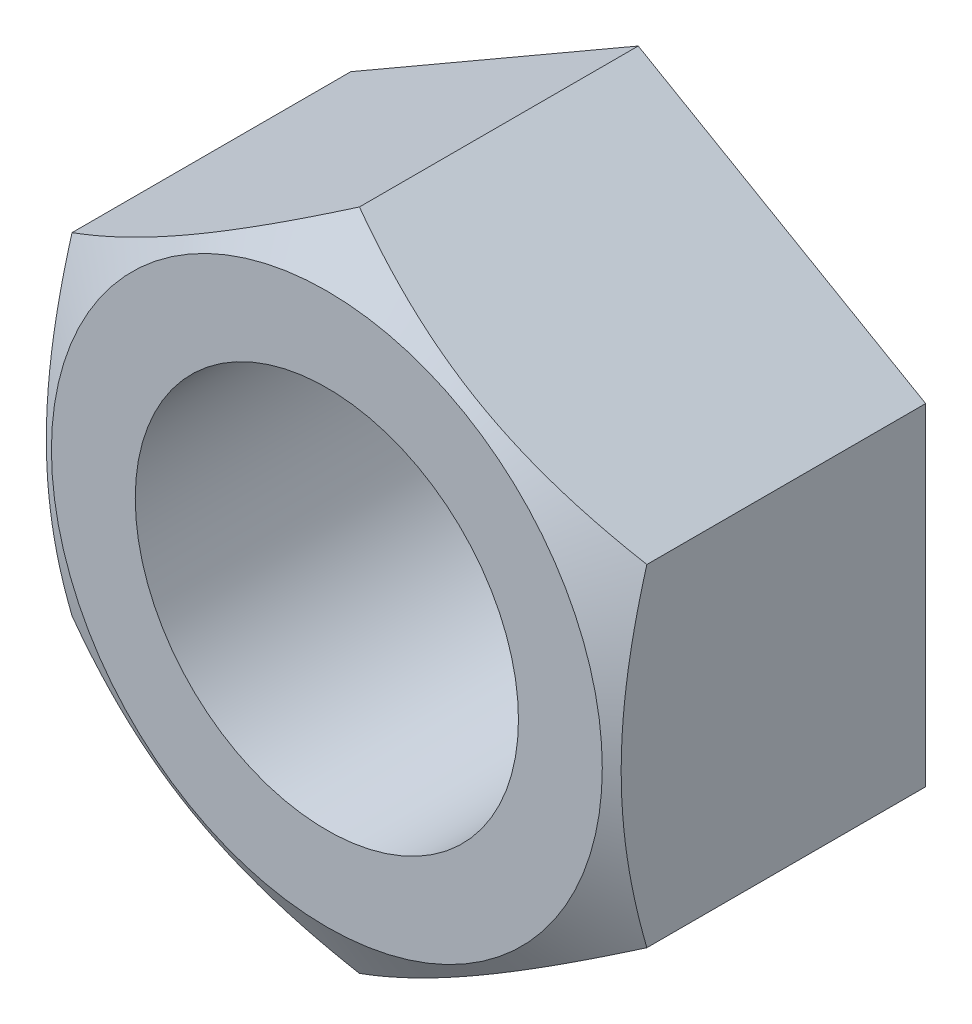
ISO-10303-21;
HEADER;
FILE_DESCRIPTION(('STEP AP214'),'2;1');
FILE_NAME('part.step','',(''),(''),'','','');
FILE_SCHEMA(('AUTOMOTIVE_DESIGN { 1 0 10303 214 1 1 1 1 }'));
ENDSEC;
DATA;
#1=APPLICATION_CONTEXT('core data for automotive mechanical design processes');
#2=APPLICATION_PROTOCOL_DEFINITION('international standard','automotive_design',2000,#1);
#3=PRODUCT_CONTEXT('',#1,'mechanical');
#4=PRODUCT('Part','Part','',(#3));
#5=PRODUCT_RELATED_PRODUCT_CATEGORY('part','',(#4));
#6=PRODUCT_DEFINITION_FORMATION('','',#4);
#7=PRODUCT_DEFINITION_CONTEXT('part definition',#1,'design');
#8=PRODUCT_DEFINITION('design','',#6,#7);
#9=PRODUCT_DEFINITION_SHAPE('','',#8);
#10=(LENGTH_UNIT() NAMED_UNIT(*) SI_UNIT(.MILLI.,.METRE.));
#11=(NAMED_UNIT(*) PLANE_ANGLE_UNIT() SI_UNIT($,.RADIAN.));
#12=(NAMED_UNIT(*) SI_UNIT($,.STERADIAN.) SOLID_ANGLE_UNIT());
#13=UNCERTAINTY_MEASURE_WITH_UNIT(LENGTH_MEASURE(1.E-05),#10,'distance_accuracy_value','');
#14=(GEOMETRIC_REPRESENTATION_CONTEXT(3) GLOBAL_UNCERTAINTY_ASSIGNED_CONTEXT((#13)) GLOBAL_UNIT_ASSIGNED_CONTEXT((#10,
#11,#12)) REPRESENTATION_CONTEXT('',''));
#15=CARTESIAN_POINT('',(0.,0.,0.));
#16=DIRECTION('',(0.,0.,1.));
#17=DIRECTION('',(1.,0.,0.));
#18=AXIS2_PLACEMENT_3D('',#15,#16,#17);
#19=CARTESIAN_POINT('',(-12.,-6.92820323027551,13.));
#20=DIRECTION('',(-1.,0.,0.));
#21=DIRECTION('',(0.,0.,1.));
#22=AXIS2_PLACEMENT_3D('',#19,#20,#21);
#23=PLANE('',#22);
#24=DIRECTION('',(0.,1.,0.));
#25=VECTOR('',#24,1.);
#26=CARTESIAN_POINT('',(-12.,-6.92820323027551,0.));
#27=LINE('',#26,#25);
#28=CARTESIAN_POINT('',(-12.,-6.92820323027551,0.));
#29=VERTEX_POINT('',#28);
#30=CARTESIAN_POINT('',(-12.,6.92820323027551,0.));
#31=VERTEX_POINT('',#30);
#32=EDGE_CURVE('E97',#29,#31,#27,.T.);
#33=ORIENTED_EDGE('',*,*,#32,.F.);
#34=DIRECTION('',(0.,0.,-1.));
#35=VECTOR('',#34,1.);
#36=CARTESIAN_POINT('',(-12.,-6.92820323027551,13.));
#37=LINE('',#36,#35);
#38=CARTESIAN_POINT('',(-12.,-6.92820323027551,11.6395280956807));
#39=VERTEX_POINT('',#38);
#40=EDGE_CURVE('E9',#39,#29,#37,.T.);
#41=ORIENTED_EDGE('',*,*,#40,.F.);
#42=CARTESIAN_POINT('',(-12.,-18.5511120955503,6.88356530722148));
#43=CARTESIAN_POINT('',(-12.,-18.2893056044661,7.01047861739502));
#44=CARTESIAN_POINT('',(-12.,-18.0271902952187,7.13675456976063));
#45=CARTESIAN_POINT('',(-12.,-17.5022775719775,7.38788728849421));
#46=CARTESIAN_POINT('',(-12.,-17.2394801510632,7.51274404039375));
#47=CARTESIAN_POINT('',(-12.,-16.4498972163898,7.88500207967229));
#48=CARTESIAN_POINT('',(-12.,-15.9219993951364,8.13005305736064));
#49=CARTESIAN_POINT('',(-12.,-14.8597501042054,8.61372635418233));
#50=CARTESIAN_POINT('',(-12.,-14.325379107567,8.85230589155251));
#51=CARTESIAN_POINT('',(-12.,-13.2523667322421,9.31962618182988));
#52=CARTESIAN_POINT('',(-12.,-12.7137255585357,9.54836740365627));
#53=CARTESIAN_POINT('',(-12.,-11.6141666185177,10.0004566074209));
#54=CARTESIAN_POINT('',(-12.,-11.053083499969,10.223404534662));
#55=CARTESIAN_POINT('',(-12.,-9.92432726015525,10.6522845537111));
#56=CARTESIAN_POINT('',(-12.,-9.35665340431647,10.8582147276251));
#57=CARTESIAN_POINT('',(-12.,-8.21491291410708,11.2476070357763));
#58=CARTESIAN_POINT('',(-12.,-7.64086209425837,11.4311151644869));
#59=CARTESIAN_POINT('',(-12.,-6.48447180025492,11.7697460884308));
#60=CARTESIAN_POINT('',(-12.,-5.90213501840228,11.9248778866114));
#61=CARTESIAN_POINT('',(-12.,-5.02392332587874,12.1302284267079));
#62=CARTESIAN_POINT('',(-12.,-4.73119449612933,12.1939857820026));
#63=CARTESIAN_POINT('',(-12.,-4.14374776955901,12.3116189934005));
#64=CARTESIAN_POINT('',(-12.,-3.84902991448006,12.3654950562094));
#65=CARTESIAN_POINT('',(-12.,-3.25781233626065,12.4624111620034));
#66=CARTESIAN_POINT('',(-12.,-2.96131263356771,12.5054513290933));
#67=CARTESIAN_POINT('',(-12.,-2.36685078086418,12.5798348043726));
#68=CARTESIAN_POINT('',(-12.,-2.06888868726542,12.6111785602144));
#69=CARTESIAN_POINT('',(-12.,-1.4757830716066,12.6611568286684));
#70=CARTESIAN_POINT('',(-12.,-1.1806530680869,12.6799507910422));
#71=CARTESIAN_POINT('',(-12.,-0.58986359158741,12.7050451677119));
#72=CARTESIAN_POINT('',(-12.,-0.294204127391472,12.7113457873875));
#73=CARTESIAN_POINT('',(-12.,0.297117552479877,12.7113038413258));
#74=CARTESIAN_POINT('',(-12.,0.592779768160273,12.7049611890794));
#75=CARTESIAN_POINT('',(-12.,1.18357555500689,12.6797863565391));
#76=CARTESIAN_POINT('',(-12.,1.47870910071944,12.6609535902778));
#77=CARTESIAN_POINT('',(-12.,2.18979135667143,12.6009289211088));
#78=CARTESIAN_POINT('',(-12.,2.60524027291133,12.5537118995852));
#79=CARTESIAN_POINT('',(-12.,3.43301837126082,12.4371140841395));
#80=CARTESIAN_POINT('',(-12.,3.84534711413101,12.3677302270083));
#81=CARTESIAN_POINT('',(-12.,4.66650397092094,12.2092670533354));
#82=CARTESIAN_POINT('',(-12.,5.07532906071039,12.1201722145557));
#83=CARTESIAN_POINT('',(-12.,5.88886052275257,11.9250022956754));
#84=CARTESIAN_POINT('',(-12.,6.29356696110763,11.8189274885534));
#85=CARTESIAN_POINT('',(-12.,7.10774269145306,11.5898730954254));
#86=CARTESIAN_POINT('',(-12.,7.51712127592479,11.466573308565));
#87=CARTESIAN_POINT('',(-12.,8.3318448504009,11.2073659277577));
#88=CARTESIAN_POINT('',(-12.,8.73718981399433,11.0714582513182));
#89=CARTESIAN_POINT('',(-12.,9.54404896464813,10.7891815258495));
#90=CARTESIAN_POINT('',(-12.,9.94556440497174,10.6428160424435));
#91=CARTESIAN_POINT('',(-12.,10.7452767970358,10.3413327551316));
#92=CARTESIAN_POINT('',(-12.,11.1434737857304,10.18621504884));
#93=CARTESIAN_POINT('',(-12.,12.0754680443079,9.81323891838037));
#94=CARTESIAN_POINT('',(-12.,12.6080647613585,9.59238523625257));
#95=CARTESIAN_POINT('',(-12.,13.6688002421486,9.14019003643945));
#96=CARTESIAN_POINT('',(-12.,14.1969387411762,8.90884790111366));
#97=CARTESIAN_POINT('',(-12.,15.2495787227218,8.43775599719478));
#98=CARTESIAN_POINT('',(-12.,15.7740794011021,8.19800443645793));
#99=CARTESIAN_POINT('',(-12.,16.8199320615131,7.71177289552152));
#100=CARTESIAN_POINT('',(-12.,17.3412841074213,7.46529305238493));
#101=CARTESIAN_POINT('',(-12.,18.3819084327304,6.96658700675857));
#102=CARTESIAN_POINT('',(-12.,18.9011779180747,6.71435498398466));
#103=CARTESIAN_POINT('',(-12.,19.9374970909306,6.20537220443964));
#104=CARTESIAN_POINT('',(-12.,20.4545467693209,5.94862142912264));
#105=CARTESIAN_POINT('',(-12.,21.4867006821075,5.43140110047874));
#106=CARTESIAN_POINT('',(-12.,22.0018051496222,5.17093201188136));
#107=CARTESIAN_POINT('',(-12.,23.0304116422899,4.64684705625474));
#108=CARTESIAN_POINT('',(-12.,23.5439136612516,4.38323117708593));
#109=CARTESIAN_POINT('',(-12.,24.9976252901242,3.63219356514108));
#110=CARTESIAN_POINT('',(-12.,25.9362166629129,3.14163958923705));
#111=CARTESIAN_POINT('',(-12.,27.8099140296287,2.15385898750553));
#112=CARTESIAN_POINT('',(-12.,28.745019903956,1.65663213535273));
#113=CARTESIAN_POINT('',(-12.,30.6102319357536,0.65827060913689));
#114=CARTESIAN_POINT('',(-12.,31.5403447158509,0.157148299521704));
#115=CARTESIAN_POINT('',(-12.,32.9338661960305,-0.59751506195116));
#116=CARTESIAN_POINT('',(-12.,33.3980865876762,-0.84955951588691));
#117=CARTESIAN_POINT('',(-12.,34.326039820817,-1.35454271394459));
#118=CARTESIAN_POINT('',(-12.,34.7897726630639,-1.60748145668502));
#119=CARTESIAN_POINT('',(-12.,35.2532891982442,-1.86081608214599));
#120=B_SPLINE_CURVE_WITH_KNOTS('',3,(#42,#43,#44,#45,#46,#47,#48,#49,#50,#51,#52,#53,#54,#55,
#56,#57,#58,#59,#60,#61,#62,#63,#64,#65,#66,#67,#68,#69,#70,#71,#72,#73,#74,#75,#76,#77,#78,#79,
#80,#81,#82,#83,#84,#85,#86,#87,#88,#89,#90,#91,#92,#93,#94,#95,#96,#97,#98,#99,#100,#101,#102,
#103,#104,#105,#106,#107,#108,#109,#110,#111,#112,#113,#114,#115,#116,#117,#118,#119),
.UNSPECIFIED.,.F.,.F.,(4,2,2,2,2,2,2,2,2,2,2,2,2,2,2,2,2,2,2,2,2,2,2,2,2,2,2,2,2,2,2,2,2,2,2,2,
2,2,4),(0.,0.872836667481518,1.74568222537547,3.49163472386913,5.24719213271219,
7.00266577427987,8.81371989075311,10.624977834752,12.4324556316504,14.2393589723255,
15.1379941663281,16.03661055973,16.9352166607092,17.8337883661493,18.7207143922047,
19.6076258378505,20.4945433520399,21.3815024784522,22.6351779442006,23.8890267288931,
25.1438664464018,26.3986859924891,27.6810742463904,28.9634708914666,30.2454323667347,
31.5273795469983,33.2569446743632,34.9866117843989,36.7166497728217,38.4466525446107,
40.1784911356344,41.9103368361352,43.6419679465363,45.3736057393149,48.5507294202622,
51.7279611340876,54.89750618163,56.4821955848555,58.0668825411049),.UNSPECIFIED.);
#121=CARTESIAN_POINT('',(-12.,6.92820323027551,11.6395280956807));
#122=VERTEX_POINT('',#121);
#123=EDGE_CURVE('E36',#39,#122,#120,.T.);
#124=ORIENTED_EDGE('',*,*,#123,.T.);
#125=DIRECTION('',(0.,0.,-1.));
#126=VECTOR('',#125,1.);
#127=CARTESIAN_POINT('',(-12.,6.92820323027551,13.));
#128=LINE('',#127,#126);
#129=EDGE_CURVE('E177',#122,#31,#128,.T.);
#130=ORIENTED_EDGE('',*,*,#129,.T.);
#131=EDGE_LOOP('',(#33,#41,#124,#130));
#132=FACE_BOUND('',#131,.T.);
#133=ADVANCED_FACE('F14',(#132),#23,.T.);
#134=CARTESIAN_POINT('',(-12.,-6.92820323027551,13.));
#135=DIRECTION('',(0.5,0.86602540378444,0.));
#136=DIRECTION('',(-0.86602540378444,0.5,0.));
#137=AXIS2_PLACEMENT_3D('',#134,#135,#136);
#138=PLANE('',#137);
#139=DIRECTION('',(-0.866025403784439,0.5,0.));
#140=VECTOR('',#139,1.);
#141=CARTESIAN_POINT('',(0.,-13.856406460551,0.));
#142=LINE('',#141,#140);
#143=CARTESIAN_POINT('',(0.,-13.856406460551,0.));
#144=VERTEX_POINT('',#143);
#145=EDGE_CURVE('E94',#144,#29,#142,.T.);
#146=ORIENTED_EDGE('',*,*,#145,.F.);
#147=DIRECTION('',(0.,0.,-1.));
#148=VECTOR('',#147,1.);
#149=CARTESIAN_POINT('',(0.,-13.856406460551,13.));
#150=LINE('',#149,#148);
#151=CARTESIAN_POINT('',(0.,-13.856406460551,11.6395280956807));
#152=VERTEX_POINT('',#151);
#153=EDGE_CURVE('E23',#152,#144,#150,.T.);
#154=ORIENTED_EDGE('',*,*,#153,.F.);
#155=CARTESIAN_POINT('',(-12.0002,-6.92808776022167,11.6394614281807));
#156=CARTESIAN_POINT('',(-11.7364142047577,-7.08038456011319,11.7273752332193));
#157=CARTESIAN_POINT('',(-11.4716448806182,-7.2332492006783,11.8112988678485));
#158=CARTESIAN_POINT('',(-10.9399829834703,-7.54020434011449,11.9700586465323));
#159=CARTESIAN_POINT('',(-10.6730897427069,-7.69429522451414,12.0448918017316));
#160=CARTESIAN_POINT('',(-9.86810959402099,-8.15905073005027,12.254307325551));
#161=CARTESIAN_POINT('',(-9.3268449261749,-8.47155003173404,12.3734216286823));
#162=CARTESIAN_POINT('',(-8.51686717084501,-8.93919090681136,12.513093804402));
#163=CARTESIAN_POINT('',(-8.25057389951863,-9.09293539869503,12.5528810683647));
#164=CARTESIAN_POINT('',(-7.71675440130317,-9.4011362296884,12.6196014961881));
#165=CARTESIAN_POINT('',(-7.44922815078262,-9.55559258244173,12.6465344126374));
#166=CARTESIAN_POINT('',(-6.91372963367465,-9.86476279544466,12.6868562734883));
#167=CARTESIAN_POINT('',(-6.64575827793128,-10.0194761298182,12.7002613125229));
#168=CARTESIAN_POINT('',(-6.10956726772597,-10.3290461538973,12.713241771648));
#169=CARTESIAN_POINT('',(-5.84134762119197,-10.4839028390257,12.7128176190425));
#170=CARTESIAN_POINT('',(-5.3399106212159,-10.7734076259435,12.6991048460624));
#171=CARTESIAN_POINT('',(-5.10665750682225,-10.908076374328,12.6874888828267));
#172=CARTESIAN_POINT('',(-4.64068775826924,-11.1771041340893,12.6540168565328));
#173=CARTESIAN_POINT('',(-4.40797116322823,-11.3114631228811,12.632160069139));
#174=CARTESIAN_POINT('',(-3.94320092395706,-11.5797983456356,12.5785874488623));
#175=CARTESIAN_POINT('',(-3.711147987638,-11.7137741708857,12.5468634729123));
#176=CARTESIAN_POINT('',(-3.24813003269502,-11.9810977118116,12.4741130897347));
#177=CARTESIAN_POINT('',(-3.01716508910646,-12.1144453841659,12.433086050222));
#178=CARTESIAN_POINT('',(-2.31605804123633,-12.5192297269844,12.2950132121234));
#179=CARTESIAN_POINT('',(-1.84794625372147,-12.789494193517,12.1841999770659));
#180=CARTESIAN_POINT('',(-0.918702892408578,-13.3259930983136,11.9326990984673));
#181=CARTESIAN_POINT('',(-0.457559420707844,-13.5922344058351,11.7920705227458));
#182=CARTESIAN_POINT('',(0.000200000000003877,-13.8565219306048,11.6394614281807));
#183=B_SPLINE_CURVE_WITH_KNOTS('',3,(#155,#156,#157,#158,#159,#160,#161,#162,#163,#164,#165,
#166,#167,#168,#169,#170,#171,#172,#173,#174,#175,#176,#177,#178,#179,#180,#181,#182),
.UNSPECIFIED.,.F.,.F.,(4,2,2,2,2,2,2,2,2,2,2,2,2,4),(0.,0.951004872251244,1.90232158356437,
3.80900466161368,4.7389455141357,5.66890426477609,6.59775529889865,7.5265776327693,
8.33514643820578,9.14377244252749,9.95306755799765,10.7624176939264,12.4167102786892,
14.0677556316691),.UNSPECIFIED.);
#184=EDGE_CURVE('E146',#39,#152,#183,.T.);
#185=ORIENTED_EDGE('',*,*,#184,.F.);
#186=ORIENTED_EDGE('',*,*,#40,.T.);
#187=EDGE_LOOP('',(#146,#154,#185,#186));
#188=FACE_BOUND('',#187,.T.);
#189=ADVANCED_FACE('F16',(#188),#138,.F.);
#190=CARTESIAN_POINT('',(12.,-6.9282032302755,13.));
#191=DIRECTION('',(0.5,-0.866025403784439,0.));
#192=DIRECTION('',(0.86602540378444,0.5,0.));
#193=AXIS2_PLACEMENT_3D('',#190,#191,#192);
#194=PLANE('',#193);
#195=DIRECTION('',(-0.866025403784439,-0.5,0.));
#196=VECTOR('',#195,1.);
#197=CARTESIAN_POINT('',(12.,-6.9282032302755,0.));
#198=LINE('',#197,#196);
#199=CARTESIAN_POINT('',(12.,-6.9282032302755,0.));
#200=VERTEX_POINT('',#199);
#201=EDGE_CURVE('E85',#200,#144,#198,.T.);
#202=ORIENTED_EDGE('',*,*,#201,.F.);
#203=DIRECTION('',(0.,0.,-1.));
#204=VECTOR('',#203,1.);
#205=CARTESIAN_POINT('',(12.,-6.9282032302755,13.));
#206=LINE('',#205,#204);
#207=CARTESIAN_POINT('',(12.,-6.9282032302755,11.6395280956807));
#208=VERTEX_POINT('',#207);
#209=EDGE_CURVE('E75',#208,#200,#206,.T.);
#210=ORIENTED_EDGE('',*,*,#209,.F.);
#211=CARTESIAN_POINT('',(12.0002,-6.92808776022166,11.6394614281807));
#212=CARTESIAN_POINT('',(11.7364142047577,-7.08038456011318,11.7273752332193));
#213=CARTESIAN_POINT('',(11.4716448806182,-7.2332492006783,11.8112988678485));
#214=CARTESIAN_POINT('',(10.9399829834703,-7.54020434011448,11.9700586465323));
#215=CARTESIAN_POINT('',(10.6730897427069,-7.69429522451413,12.0448918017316));
#216=CARTESIAN_POINT('',(9.86810959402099,-8.15905073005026,12.254307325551));
#217=CARTESIAN_POINT('',(9.3268449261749,-8.47155003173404,12.3734216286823));
#218=CARTESIAN_POINT('',(8.51686717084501,-8.93919090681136,12.513093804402));
#219=CARTESIAN_POINT('',(8.25057389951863,-9.09293539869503,12.5528810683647));
#220=CARTESIAN_POINT('',(7.71675440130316,-9.4011362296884,12.6196014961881));
#221=CARTESIAN_POINT('',(7.44922815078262,-9.55559258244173,12.6465344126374));
#222=CARTESIAN_POINT('',(6.91372963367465,-9.86476279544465,12.6868562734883));
#223=CARTESIAN_POINT('',(6.64575827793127,-10.0194761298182,12.7002613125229));
#224=CARTESIAN_POINT('',(6.10956726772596,-10.3290461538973,12.713241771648));
#225=CARTESIAN_POINT('',(5.84134762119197,-10.4839028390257,12.7128176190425));
#226=CARTESIAN_POINT('',(5.3399106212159,-10.7734076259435,12.6991048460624));
#227=CARTESIAN_POINT('',(5.10665750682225,-10.908076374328,12.6874888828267));
#228=CARTESIAN_POINT('',(4.64068775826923,-11.1771041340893,12.6540168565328));
#229=CARTESIAN_POINT('',(4.40797116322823,-11.3114631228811,12.632160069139));
#230=CARTESIAN_POINT('',(3.94320092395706,-11.5797983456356,12.5785874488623));
#231=CARTESIAN_POINT('',(3.711147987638,-11.7137741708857,12.5468634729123));
#232=CARTESIAN_POINT('',(3.24813003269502,-11.9810977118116,12.4741130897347));
#233=CARTESIAN_POINT('',(3.01716508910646,-12.1144453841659,12.433086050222));
#234=CARTESIAN_POINT('',(2.31605804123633,-12.5192297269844,12.2950132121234));
#235=CARTESIAN_POINT('',(1.84794625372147,-12.789494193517,12.1841999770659));
#236=CARTESIAN_POINT('',(0.918702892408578,-13.3259930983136,11.9326990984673));
#237=CARTESIAN_POINT('',(0.457559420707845,-13.5922344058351,11.7920705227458));
#238=CARTESIAN_POINT('',(-0.000200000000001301,-13.8565219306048,11.6394614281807));
#239=B_SPLINE_CURVE_WITH_KNOTS('',3,(#211,#212,#213,#214,#215,#216,#217,#218,#219,#220,#221,
#222,#223,#224,#225,#226,#227,#228,#229,#230,#231,#232,#233,#234,#235,#236,#237,#238),
.UNSPECIFIED.,.F.,.F.,(4,2,2,2,2,2,2,2,2,2,2,2,2,4),(0.,0.951004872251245,1.90232158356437,
3.80900466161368,4.7389455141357,5.66890426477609,6.59775529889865,7.5265776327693,
8.33514643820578,9.14377244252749,9.95306755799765,10.7624176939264,12.4167102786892,
14.0677556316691),.UNSPECIFIED.);
#240=EDGE_CURVE('E140',#208,#152,#239,.T.);
#241=ORIENTED_EDGE('',*,*,#240,.T.);
#242=ORIENTED_EDGE('',*,*,#153,.T.);
#243=EDGE_LOOP('',(#202,#210,#241,#242));
#244=FACE_BOUND('',#243,.T.);
#245=ADVANCED_FACE('F185',(#244),#194,.T.);
#246=CARTESIAN_POINT('',(12.,-6.9282032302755,13.));
#247=DIRECTION('',(-1.,0.,0.));
#248=DIRECTION('',(0.,0.,1.));
#249=AXIS2_PLACEMENT_3D('',#246,#247,#248);
#250=PLANE('',#249);
#251=DIRECTION('',(0.,-1.,0.));
#252=VECTOR('',#251,1.);
#253=CARTESIAN_POINT('',(12.,6.92820323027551,0.));
#254=LINE('',#253,#252);
#255=CARTESIAN_POINT('',(12.,6.92820323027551,0.));
#256=VERTEX_POINT('',#255);
#257=EDGE_CURVE('E79',#256,#200,#254,.T.);
#258=ORIENTED_EDGE('',*,*,#257,.F.);
#259=DIRECTION('',(0.,0.,-1.));
#260=VECTOR('',#259,1.);
#261=CARTESIAN_POINT('',(12.,6.92820323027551,13.));
#262=LINE('',#261,#260);
#263=CARTESIAN_POINT('',(12.,6.92820323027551,11.6395280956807));
#264=VERTEX_POINT('',#263);
#265=EDGE_CURVE('E66',#264,#256,#262,.T.);
#266=ORIENTED_EDGE('',*,*,#265,.F.);
#267=CARTESIAN_POINT('',(12.,-18.5511120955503,6.88356530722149));
#268=CARTESIAN_POINT('',(12.,-18.2893056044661,7.01047861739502));
#269=CARTESIAN_POINT('',(12.,-18.0271902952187,7.13675456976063));
#270=CARTESIAN_POINT('',(12.,-17.5022775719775,7.38788728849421));
#271=CARTESIAN_POINT('',(12.,-17.2394801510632,7.51274404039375));
#272=CARTESIAN_POINT('',(12.,-16.4498972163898,7.88500207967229));
#273=CARTESIAN_POINT('',(12.,-15.9219993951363,8.13005305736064));
#274=CARTESIAN_POINT('',(12.,-14.8597501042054,8.61372635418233));
#275=CARTESIAN_POINT('',(12.,-14.325379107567,8.85230589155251));
#276=CARTESIAN_POINT('',(12.,-13.2523667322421,9.31962618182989));
#277=CARTESIAN_POINT('',(12.,-12.7137255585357,9.54836740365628));
#278=CARTESIAN_POINT('',(12.,-11.6141666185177,10.0004566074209));
#279=CARTESIAN_POINT('',(12.,-11.053083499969,10.223404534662));
#280=CARTESIAN_POINT('',(12.,-9.92432726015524,10.6522845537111));
#281=CARTESIAN_POINT('',(12.,-9.35665340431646,10.8582147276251));
#282=CARTESIAN_POINT('',(12.,-8.21491291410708,11.2476070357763));
#283=CARTESIAN_POINT('',(12.,-7.64086209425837,11.4311151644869));
#284=CARTESIAN_POINT('',(12.,-6.48447180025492,11.7697460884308));
#285=CARTESIAN_POINT('',(12.,-5.90213501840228,11.9248778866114));
#286=CARTESIAN_POINT('',(12.,-5.02392332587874,12.1302284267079));
#287=CARTESIAN_POINT('',(12.,-4.73119449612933,12.1939857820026));
#288=CARTESIAN_POINT('',(12.,-4.14374776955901,12.3116189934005));
#289=CARTESIAN_POINT('',(12.,-3.84902991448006,12.3654950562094));
#290=CARTESIAN_POINT('',(12.,-3.25781233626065,12.4624111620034));
#291=CARTESIAN_POINT('',(12.,-2.9613126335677,12.5054513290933));
#292=CARTESIAN_POINT('',(12.,-2.36685078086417,12.5798348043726));
#293=CARTESIAN_POINT('',(12.,-2.06888868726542,12.6111785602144));
#294=CARTESIAN_POINT('',(12.,-1.4757830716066,12.6611568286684));
#295=CARTESIAN_POINT('',(12.,-1.1806530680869,12.6799507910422));
#296=CARTESIAN_POINT('',(12.,-0.589863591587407,12.7050451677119));
#297=CARTESIAN_POINT('',(12.,-0.294204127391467,12.7113457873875));
#298=CARTESIAN_POINT('',(12.,0.297117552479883,12.7113038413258));
#299=CARTESIAN_POINT('',(12.,0.592779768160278,12.7049611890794));
#300=CARTESIAN_POINT('',(12.,1.18357555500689,12.6797863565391));
#301=CARTESIAN_POINT('',(12.,1.47870910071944,12.6609535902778));
#302=CARTESIAN_POINT('',(12.,2.18979135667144,12.6009289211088));
#303=CARTESIAN_POINT('',(12.,2.60524027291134,12.5537118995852));
#304=CARTESIAN_POINT('',(12.,3.43301837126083,12.4371140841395));
#305=CARTESIAN_POINT('',(12.,3.84534711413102,12.3677302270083));
#306=CARTESIAN_POINT('',(12.,4.66650397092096,12.2092670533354));
#307=CARTESIAN_POINT('',(12.,5.07532906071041,12.1201722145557));
#308=CARTESIAN_POINT('',(12.,5.88886052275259,11.9250022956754));
#309=CARTESIAN_POINT('',(12.,6.29356696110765,11.8189274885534));
#310=CARTESIAN_POINT('',(12.,7.10774269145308,11.5898730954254));
#311=CARTESIAN_POINT('',(12.,7.51712127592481,11.466573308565));
#312=CARTESIAN_POINT('',(12.,8.33184485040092,11.2073659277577));
#313=CARTESIAN_POINT('',(12.,8.73718981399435,11.0714582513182));
#314=CARTESIAN_POINT('',(12.,9.54404896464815,10.7891815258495));
#315=CARTESIAN_POINT('',(12.,9.94556440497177,10.6428160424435));
#316=CARTESIAN_POINT('',(12.,10.7452767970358,10.3413327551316));
#317=CARTESIAN_POINT('',(12.,11.1434737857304,10.18621504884));
#318=CARTESIAN_POINT('',(12.,12.0754680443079,9.81323891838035));
#319=CARTESIAN_POINT('',(12.,12.6080647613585,9.59238523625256));
#320=CARTESIAN_POINT('',(12.,13.6688002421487,9.14019003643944));
#321=CARTESIAN_POINT('',(12.,14.1969387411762,8.90884790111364));
#322=CARTESIAN_POINT('',(12.,15.2495787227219,8.43775599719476));
#323=CARTESIAN_POINT('',(12.,15.7740794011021,8.19800443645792));
#324=CARTESIAN_POINT('',(12.,16.8199320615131,7.71177289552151));
#325=CARTESIAN_POINT('',(12.,17.3412841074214,7.46529305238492));
#326=CARTESIAN_POINT('',(12.,18.3819084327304,6.96658700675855));
#327=CARTESIAN_POINT('',(12.,18.9011779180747,6.71435498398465));
#328=CARTESIAN_POINT('',(12.,19.9374970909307,6.20537220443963));
#329=CARTESIAN_POINT('',(12.,20.4545467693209,5.94862142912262));
#330=CARTESIAN_POINT('',(12.,21.4867006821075,5.43140110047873));
#331=CARTESIAN_POINT('',(12.,22.0018051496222,5.17093201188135));
#332=CARTESIAN_POINT('',(12.,23.03041164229,4.64684705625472));
#333=CARTESIAN_POINT('',(12.,23.5439136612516,4.38323117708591));
#334=CARTESIAN_POINT('',(12.,24.9976252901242,3.63219356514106));
#335=CARTESIAN_POINT('',(12.,25.9362166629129,3.14163958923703));
#336=CARTESIAN_POINT('',(12.,27.8099140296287,2.15385898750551));
#337=CARTESIAN_POINT('',(12.,28.745019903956,1.65663213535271));
#338=CARTESIAN_POINT('',(12.,30.6102319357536,0.658270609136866));
#339=CARTESIAN_POINT('',(12.,31.5403447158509,0.157148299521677));
#340=CARTESIAN_POINT('',(12.,32.9338661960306,-0.597515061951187));
#341=CARTESIAN_POINT('',(12.,33.3980865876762,-0.849559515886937));
#342=CARTESIAN_POINT('',(12.,34.3260398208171,-1.35454271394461));
#343=CARTESIAN_POINT('',(12.,34.7897726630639,-1.60748145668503));
#344=CARTESIAN_POINT('',(12.,35.2532891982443,-1.86081608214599));
#345=B_SPLINE_CURVE_WITH_KNOTS('',3,(#267,#268,#269,#270,#271,#272,#273,#274,#275,#276,#277,
#278,#279,#280,#281,#282,#283,#284,#285,#286,#287,#288,#289,#290,#291,#292,#293,#294,#295,#296,
#297,#298,#299,#300,#301,#302,#303,#304,#305,#306,#307,#308,#309,#310,#311,#312,#313,#314,#315,
#316,#317,#318,#319,#320,#321,#322,#323,#324,#325,#326,#327,#328,#329,#330,#331,#332,#333,#334,
#335,#336,#337,#338,#339,#340,#341,#342,#343,#344),.UNSPECIFIED.,.F.,.F.,(4,2,2,2,2,2,2,2,2,2,2,
2,2,2,2,2,2,2,2,2,2,2,2,2,2,2,2,2,2,2,2,2,2,2,2,2,2,2,4),(0.,0.872836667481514,1.74568222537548,
3.49163472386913,5.2471921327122,7.00266577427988,8.81371989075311,10.624977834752,
12.4324556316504,14.2393589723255,15.1379941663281,16.03661055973,16.9352166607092,
17.8337883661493,18.7207143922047,19.6076258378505,20.4945433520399,21.3815024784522,
22.6351779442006,23.8890267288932,25.1438664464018,26.3986859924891,27.6810742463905,
28.9634708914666,30.2454323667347,31.5273795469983,33.2569446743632,34.9866117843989,
36.7166497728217,38.4466525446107,40.1784911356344,41.9103368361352,43.6419679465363,
45.3736057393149,48.5507294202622,51.7279611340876,54.8975061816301,56.4821955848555,
58.066882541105),.UNSPECIFIED.);
#346=EDGE_CURVE('E133',#208,#264,#345,.T.);
#347=ORIENTED_EDGE('',*,*,#346,.F.);
#348=ORIENTED_EDGE('',*,*,#209,.T.);
#349=EDGE_LOOP('',(#258,#266,#347,#348));
#350=FACE_BOUND('',#349,.T.);
#351=ADVANCED_FACE('F80',(#350),#250,.F.);
#352=CARTESIAN_POINT('',(12.,6.92820323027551,13.));
#353=DIRECTION('',(-0.5,-0.86602540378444,0.));
#354=DIRECTION('',(0.86602540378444,-0.5,0.));
#355=AXIS2_PLACEMENT_3D('',#352,#353,#354);
#356=PLANE('',#355);
#357=DIRECTION('',(0.866025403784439,-0.5,0.));
#358=VECTOR('',#357,1.);
#359=CARTESIAN_POINT('',(0.,13.856406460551,0.));
#360=LINE('',#359,#358);
#361=CARTESIAN_POINT('',(0.,13.856406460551,0.));
#362=VERTEX_POINT('',#361);
#363=EDGE_CURVE('E71',#362,#256,#360,.T.);
#364=ORIENTED_EDGE('',*,*,#363,.F.);
#365=DIRECTION('',(0.,0.,-1.));
#366=VECTOR('',#365,1.);
#367=CARTESIAN_POINT('',(0.,13.856406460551,13.));
#368=LINE('',#367,#366);
#369=CARTESIAN_POINT('',(0.,13.856406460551,11.6395280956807));
#370=VERTEX_POINT('',#369);
#371=EDGE_CURVE('E76',#370,#362,#368,.T.);
#372=ORIENTED_EDGE('',*,*,#371,.F.);
#373=CARTESIAN_POINT('',(12.0002,6.92808776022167,11.6394614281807));
#374=CARTESIAN_POINT('',(11.7364142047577,7.08038456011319,11.7273752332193));
#375=CARTESIAN_POINT('',(11.4716448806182,7.2332492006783,11.8112988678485));
#376=CARTESIAN_POINT('',(10.9399829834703,7.54020434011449,11.9700586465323));
#377=CARTESIAN_POINT('',(10.6730897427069,7.69429522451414,12.0448918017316));
#378=CARTESIAN_POINT('',(9.86810959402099,8.15905073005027,12.254307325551));
#379=CARTESIAN_POINT('',(9.3268449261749,8.47155003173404,12.3734216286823));
#380=CARTESIAN_POINT('',(8.51686717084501,8.93919090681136,12.513093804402));
#381=CARTESIAN_POINT('',(8.25057389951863,9.09293539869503,12.5528810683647));
#382=CARTESIAN_POINT('',(7.71675440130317,9.4011362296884,12.6196014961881));
#383=CARTESIAN_POINT('',(7.44922815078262,9.55559258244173,12.6465344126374));
#384=CARTESIAN_POINT('',(6.91372963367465,9.86476279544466,12.6868562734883));
#385=CARTESIAN_POINT('',(6.64575827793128,10.0194761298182,12.7002613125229));
#386=CARTESIAN_POINT('',(6.10956726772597,10.3290461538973,12.713241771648));
#387=CARTESIAN_POINT('',(5.84134762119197,10.4839028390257,12.7128176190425));
#388=CARTESIAN_POINT('',(5.3399106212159,10.7734076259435,12.6991048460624));
#389=CARTESIAN_POINT('',(5.10665750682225,10.908076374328,12.6874888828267));
#390=CARTESIAN_POINT('',(4.64068775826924,11.1771041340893,12.6540168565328));
#391=CARTESIAN_POINT('',(4.40797116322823,11.3114631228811,12.632160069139));
#392=CARTESIAN_POINT('',(3.94320092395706,11.5797983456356,12.5785874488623));
#393=CARTESIAN_POINT('',(3.711147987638,11.7137741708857,12.5468634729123));
#394=CARTESIAN_POINT('',(3.24813003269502,11.9810977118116,12.4741130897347));
#395=CARTESIAN_POINT('',(3.01716508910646,12.1144453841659,12.433086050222));
#396=CARTESIAN_POINT('',(2.31605804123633,12.5192297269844,12.2950132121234));
#397=CARTESIAN_POINT('',(1.84794625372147,12.789494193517,12.1841999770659));
#398=CARTESIAN_POINT('',(0.918702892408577,13.3259930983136,11.9326990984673));
#399=CARTESIAN_POINT('',(0.457559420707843,13.5922344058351,11.7920705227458));
#400=CARTESIAN_POINT('',(-0.000200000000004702,13.8565219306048,11.6394614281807));
#401=B_SPLINE_CURVE_WITH_KNOTS('',3,(#373,#374,#375,#376,#377,#378,#379,#380,#381,#382,#383,
#384,#385,#386,#387,#388,#389,#390,#391,#392,#393,#394,#395,#396,#397,#398,#399,#400),
.UNSPECIFIED.,.F.,.F.,(4,2,2,2,2,2,2,2,2,2,2,2,2,4),(0.,0.951004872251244,1.90232158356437,
3.80900466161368,4.7389455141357,5.66890426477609,6.59775529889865,7.5265776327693,
8.33514643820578,9.14377244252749,9.95306755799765,10.7624176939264,12.4167102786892,
14.0677556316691),.UNSPECIFIED.);
#402=EDGE_CURVE('E30',#264,#370,#401,.T.);
#403=ORIENTED_EDGE('',*,*,#402,.F.);
#404=ORIENTED_EDGE('',*,*,#265,.T.);
#405=EDGE_LOOP('',(#364,#372,#403,#404));
#406=FACE_BOUND('',#405,.T.);
#407=ADVANCED_FACE('F68',(#406),#356,.F.);
#408=CARTESIAN_POINT('',(-12.,6.92820323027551,13.));
#409=DIRECTION('',(-0.5,0.86602540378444,0.));
#410=DIRECTION('',(-0.86602540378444,-0.5,0.));
#411=AXIS2_PLACEMENT_3D('',#408,#409,#410);
#412=PLANE('',#411);
#413=DIRECTION('',(0.866025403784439,0.5,0.));
#414=VECTOR('',#413,1.);
#415=CARTESIAN_POINT('',(-12.,6.92820323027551,0.));
#416=LINE('',#415,#414);
#417=EDGE_CURVE('E90',#31,#362,#416,.T.);
#418=ORIENTED_EDGE('',*,*,#417,.F.);
#419=ORIENTED_EDGE('',*,*,#129,.F.);
#420=CARTESIAN_POINT('',(-12.0002,6.92808776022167,11.6394614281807));
#421=CARTESIAN_POINT('',(-11.7364142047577,7.08038456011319,11.7273752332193));
#422=CARTESIAN_POINT('',(-11.4716448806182,7.2332492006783,11.8112988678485));
#423=CARTESIAN_POINT('',(-10.9399829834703,7.54020434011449,11.9700586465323));
#424=CARTESIAN_POINT('',(-10.6730897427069,7.69429522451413,12.0448918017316));
#425=CARTESIAN_POINT('',(-9.86810959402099,8.15905073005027,12.254307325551));
#426=CARTESIAN_POINT('',(-9.3268449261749,8.47155003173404,12.3734216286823));
#427=CARTESIAN_POINT('',(-8.51686717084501,8.93919090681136,12.513093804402));
#428=CARTESIAN_POINT('',(-8.25057389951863,9.09293539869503,12.5528810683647));
#429=CARTESIAN_POINT('',(-7.71675440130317,9.4011362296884,12.6196014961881));
#430=CARTESIAN_POINT('',(-7.44922815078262,9.55559258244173,12.6465344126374));
#431=CARTESIAN_POINT('',(-6.91372963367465,9.86476279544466,12.6868562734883));
#432=CARTESIAN_POINT('',(-6.64575827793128,10.0194761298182,12.7002613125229));
#433=CARTESIAN_POINT('',(-6.10956726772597,10.3290461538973,12.713241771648));
#434=CARTESIAN_POINT('',(-5.84134762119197,10.4839028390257,12.7128176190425));
#435=CARTESIAN_POINT('',(-5.3399106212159,10.7734076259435,12.6991048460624));
#436=CARTESIAN_POINT('',(-5.10665750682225,10.908076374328,12.6874888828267));
#437=CARTESIAN_POINT('',(-4.64068775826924,11.1771041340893,12.6540168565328));
#438=CARTESIAN_POINT('',(-4.40797116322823,11.3114631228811,12.632160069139));
#439=CARTESIAN_POINT('',(-3.94320092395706,11.5797983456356,12.5785874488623));
#440=CARTESIAN_POINT('',(-3.711147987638,11.7137741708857,12.5468634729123));
#441=CARTESIAN_POINT('',(-3.24813003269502,11.9810977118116,12.4741130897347));
#442=CARTESIAN_POINT('',(-3.01716508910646,12.1144453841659,12.433086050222));
#443=CARTESIAN_POINT('',(-2.31605804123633,12.5192297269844,12.2950132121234));
#444=CARTESIAN_POINT('',(-1.84794625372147,12.789494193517,12.1841999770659));
#445=CARTESIAN_POINT('',(-0.91870289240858,13.3259930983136,11.9326990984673));
#446=CARTESIAN_POINT('',(-0.457559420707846,13.5922344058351,11.7920705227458));
#447=CARTESIAN_POINT('',(0.000200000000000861,13.8565219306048,11.6394614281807));
#448=B_SPLINE_CURVE_WITH_KNOTS('',3,(#420,#421,#422,#423,#424,#425,#426,#427,#428,#429,#430,
#431,#432,#433,#434,#435,#436,#437,#438,#439,#440,#441,#442,#443,#444,#445,#446,#447),
.UNSPECIFIED.,.F.,.F.,(4,2,2,2,2,2,2,2,2,2,2,2,2,4),(0.,0.951004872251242,1.90232158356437,
3.80900466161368,4.7389455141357,5.66890426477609,6.59775529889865,7.5265776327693,
8.33514643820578,9.14377244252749,9.95306755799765,10.7624176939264,12.4167102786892,
14.0677556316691),.UNSPECIFIED.);
#449=EDGE_CURVE('E103',#122,#370,#448,.T.);
#450=ORIENTED_EDGE('',*,*,#449,.T.);
#451=ORIENTED_EDGE('',*,*,#371,.T.);
#452=EDGE_LOOP('',(#418,#419,#450,#451));
#453=FACE_BOUND('',#452,.T.);
#454=ADVANCED_FACE('F117',(#453),#412,.T.);
#455=CARTESIAN_POINT('',(-12.,6.92820323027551,13.));
#456=DIRECTION('',(0.,0.,1.));
#457=DIRECTION('',(1.,0.,0.));
#458=AXIS2_PLACEMENT_3D('',#455,#456,#457);
#459=PLANE('',#458);
#460=CARTESIAN_POINT('',(0.,0.,13.));
#461=DIRECTION('',(0.,0.,1.));
#462=DIRECTION('',(1.,0.,0.));
#463=AXIS2_PLACEMENT_3D('',#460,#461,#462);
#464=CIRCLE('',#463,8.);
#465=CARTESIAN_POINT('',(8.,0.,13.));
#466=VERTEX_POINT('',#465);
#467=EDGE_CURVE('E156',#466,#466,#464,.T.);
#468=ORIENTED_EDGE('',*,*,#467,.F.);
#469=EDGE_LOOP('',(#468));
#470=FACE_BOUND('',#469,.T.);
#471=CARTESIAN_POINT('',(0.,0.,13.));
#472=DIRECTION('',(0.,0.,1.));
#473=DIRECTION('',(1.,0.,0.));
#474=AXIS2_PLACEMENT_3D('',#471,#472,#473);
#475=CIRCLE('',#474,11.5);
#476=CARTESIAN_POINT('',(11.5,0.,13.));
#477=VERTEX_POINT('',#476);
#478=EDGE_CURVE('E100',#477,#477,#475,.T.);
#479=ORIENTED_EDGE('',*,*,#478,.T.);
#480=EDGE_LOOP('',(#479));
#481=FACE_BOUND('',#480,.T.);
#482=ADVANCED_FACE('F125',(#470,#481),#459,.T.);
#483=CARTESIAN_POINT('',(-12.,6.92820323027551,0.));
#484=DIRECTION('',(0.,0.,-1.));
#485=DIRECTION('',(0.,-1.,0.));
#486=AXIS2_PLACEMENT_3D('',#483,#484,#485);
#487=PLANE('',#486);
#488=CARTESIAN_POINT('',(0.,0.,0.));
#489=DIRECTION('',(0.,0.,1.));
#490=DIRECTION('',(0.,1.,0.));
#491=AXIS2_PLACEMENT_3D('',#488,#489,#490);
#492=CIRCLE('',#491,8.);
#493=CARTESIAN_POINT('',(0.,8.,0.));
#494=VERTEX_POINT('',#493);
#495=EDGE_CURVE('E173',#494,#494,#492,.T.);
#496=ORIENTED_EDGE('',*,*,#495,.T.);
#497=EDGE_LOOP('',(#496));
#498=FACE_BOUND('',#497,.T.);
#499=ORIENTED_EDGE('',*,*,#363,.T.);
#500=ORIENTED_EDGE('',*,*,#257,.T.);
#501=ORIENTED_EDGE('',*,*,#201,.T.);
#502=ORIENTED_EDGE('',*,*,#145,.T.);
#503=ORIENTED_EDGE('',*,*,#32,.T.);
#504=ORIENTED_EDGE('',*,*,#417,.T.);
#505=EDGE_LOOP('',(#499,#500,#501,#502,#503,#504));
#506=FACE_BOUND('',#505,.T.);
#507=ADVANCED_FACE('F87',(#498,#506),#487,.T.);
#508=CARTESIAN_POINT('',(0.,0.,13.));
#509=DIRECTION('',(0.,0.,-1.));
#510=DIRECTION('',(0.,-1.,0.));
#511=AXIS2_PLACEMENT_3D('',#508,#509,#510);
#512=CYLINDRICAL_SURFACE('',#511,8.);
#513=ORIENTED_EDGE('',*,*,#495,.F.);
#514=EDGE_LOOP('',(#513));
#515=FACE_BOUND('',#514,.T.);
#516=ORIENTED_EDGE('',*,*,#467,.T.);
#517=EDGE_LOOP('',(#516));
#518=FACE_BOUND('',#517,.T.);
#519=ADVANCED_FACE('F124',(#515,#518),#512,.F.);
#520=CARTESIAN_POINT('',(0.,0.,13.));
#521=DIRECTION('',(0.,0.,-1.));
#522=DIRECTION('',(-1.,0.,0.));
#523=AXIS2_PLACEMENT_3D('',#520,#521,#522);
#524=CONICAL_SURFACE('',#523,11.5,1.0471975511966);
#525=ORIENTED_EDGE('',*,*,#184,.T.);
#526=ORIENTED_EDGE('',*,*,#240,.F.);
#527=ORIENTED_EDGE('',*,*,#346,.T.);
#528=ORIENTED_EDGE('',*,*,#402,.T.);
#529=ORIENTED_EDGE('',*,*,#449,.F.);
#530=ORIENTED_EDGE('',*,*,#123,.F.);
#531=EDGE_LOOP('',(#525,#526,#527,#528,#529,#530));
#532=FACE_BOUND('',#531,.T.);
#533=ORIENTED_EDGE('',*,*,#478,.F.);
#534=EDGE_LOOP('',(#533));
#535=FACE_BOUND('',#534,.T.);
#536=ADVANCED_FACE('F120',(#532,#535),#524,.T.);
#537=CLOSED_SHELL('',(#133,#189,#245,#351,#407,#454,#482,#507,#519,#536));
#538=MANIFOLD_SOLID_BREP('B1',#537);
#539=ADVANCED_BREP_SHAPE_REPRESENTATION('',(#18,#538),#14);
#540=SHAPE_DEFINITION_REPRESENTATION(#9,#539);
ENDSEC;
END-ISO-10303-21;
